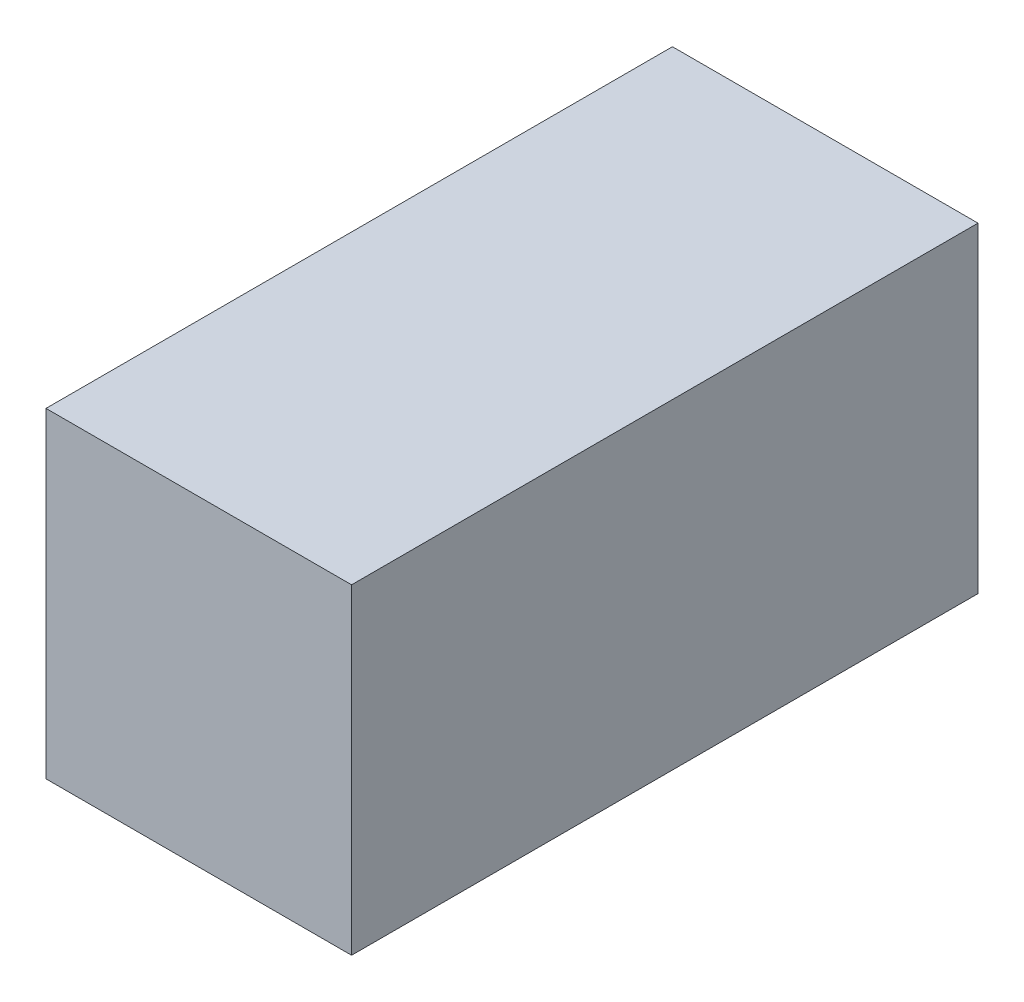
from build123d import *

# Parameters (mm, degrees)
SKETCH1_W           = 2
SKETCH1_H           = 4.1
BOSS_EXTRUDE1_DEPTH = 2.1


with BuildPart() as part:
    # Sketch1 → Boss-Extrude1 (new body)
    with BuildSketch(Plane(origin=(0, 0, 0), x_dir=(1, 0, 0), z_dir=(0, 1, 0))):
        Rectangle(SKETCH1_W, SKETCH1_H)
    extrude(amount=BOSS_EXTRUDE1_DEPTH)


solid = part.part
